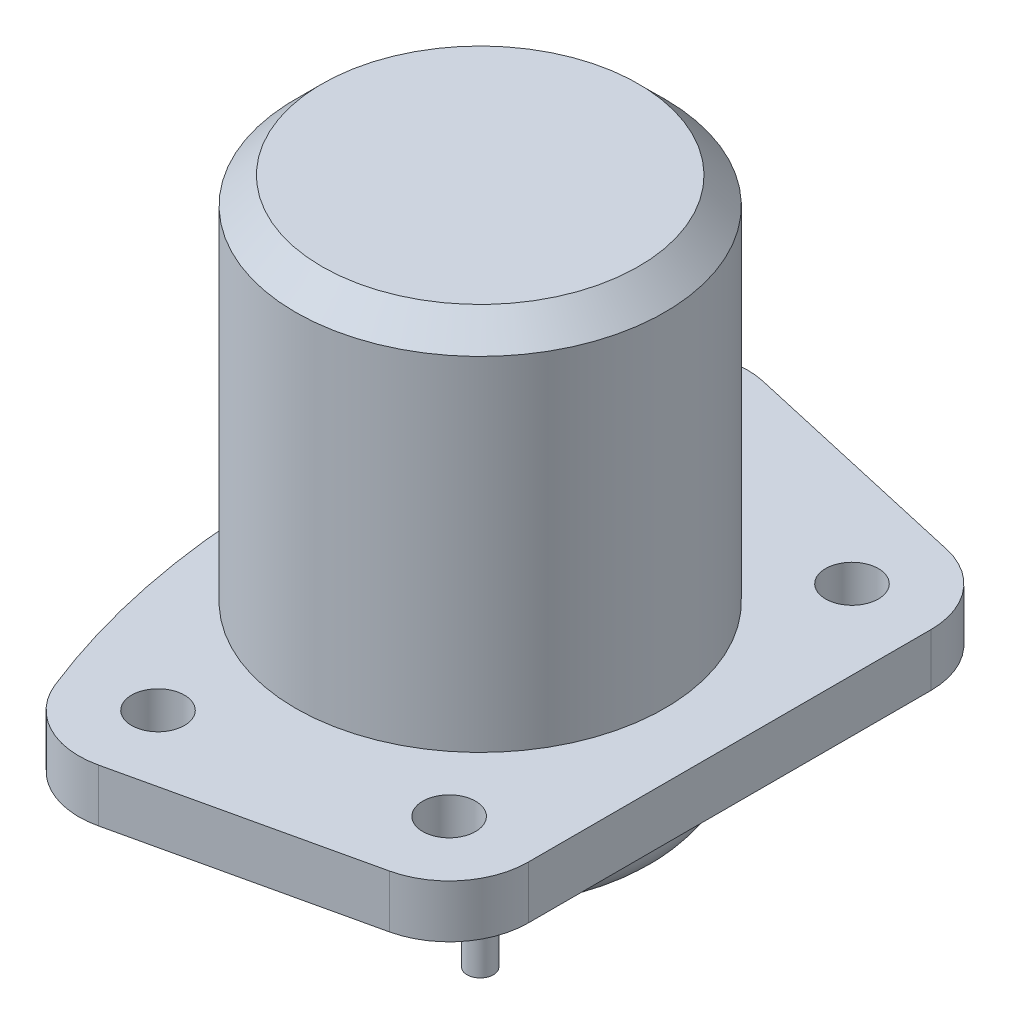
ISO-10303-21;
HEADER;
FILE_DESCRIPTION(('STEP AP214'),'2;1');
FILE_NAME('part.step','',(''),(''),'','','');
FILE_SCHEMA(('AUTOMOTIVE_DESIGN { 1 0 10303 214 1 1 1 1 }'));
ENDSEC;
DATA;
#1=APPLICATION_CONTEXT('core data for automotive mechanical design processes');
#2=APPLICATION_PROTOCOL_DEFINITION('international standard','automotive_design',2000,#1);
#3=PRODUCT_CONTEXT('',#1,'mechanical');
#4=PRODUCT('Part','Part','',(#3));
#5=PRODUCT_RELATED_PRODUCT_CATEGORY('part','',(#4));
#6=PRODUCT_DEFINITION_FORMATION('','',#4);
#7=PRODUCT_DEFINITION_CONTEXT('part definition',#1,'design');
#8=PRODUCT_DEFINITION('design','',#6,#7);
#9=PRODUCT_DEFINITION_SHAPE('','',#8);
#10=(LENGTH_UNIT() NAMED_UNIT(*) SI_UNIT(.MILLI.,.METRE.));
#11=(NAMED_UNIT(*) PLANE_ANGLE_UNIT() SI_UNIT($,.RADIAN.));
#12=(NAMED_UNIT(*) SI_UNIT($,.STERADIAN.) SOLID_ANGLE_UNIT());
#13=UNCERTAINTY_MEASURE_WITH_UNIT(LENGTH_MEASURE(1.E-05),#10,'distance_accuracy_value','');
#14=(GEOMETRIC_REPRESENTATION_CONTEXT(3) GLOBAL_UNCERTAINTY_ASSIGNED_CONTEXT((#13)) GLOBAL_UNIT_ASSIGNED_CONTEXT((#10,
#11,#12)) REPRESENTATION_CONTEXT('',''));
#15=CARTESIAN_POINT('',(0.,0.,0.));
#16=DIRECTION('',(0.,0.,1.));
#17=DIRECTION('',(1.,0.,0.));
#18=AXIS2_PLACEMENT_3D('',#15,#16,#17);
#19=CARTESIAN_POINT('',(0.,50.,0.));
#20=DIRECTION('',(0.,-1.,0.));
#21=DIRECTION('',(0.,0.,-1.));
#22=AXIS2_PLACEMENT_3D('',#19,#20,#21);
#23=CYLINDRICAL_SURFACE('',#22,17.5);
#24=CARTESIAN_POINT('',(0.,5.,0.));
#25=DIRECTION('',(0.,1.,0.));
#26=DIRECTION('',(0.,0.,1.));
#27=AXIS2_PLACEMENT_3D('',#24,#25,#26);
#28=CIRCLE('',#27,17.5);
#29=CARTESIAN_POINT('',(0.,5.,17.5));
#30=VERTEX_POINT('',#29);
#31=EDGE_CURVE('E192',#30,#30,#28,.T.);
#32=ORIENTED_EDGE('',*,*,#31,.T.);
#33=EDGE_LOOP('',(#32));
#34=FACE_BOUND('',#33,.T.);
#35=CARTESIAN_POINT('',(0.,10.,0.));
#36=DIRECTION('',(0.,1.,0.));
#37=DIRECTION('',(0.,0.,1.));
#38=AXIS2_PLACEMENT_3D('',#35,#36,#37);
#39=CIRCLE('',#38,17.5);
#40=CARTESIAN_POINT('',(0.,10.,17.5));
#41=VERTEX_POINT('',#40);
#42=EDGE_CURVE('E11',#41,#41,#39,.T.);
#43=ORIENTED_EDGE('',*,*,#42,.F.);
#44=EDGE_LOOP('',(#43));
#45=FACE_BOUND('',#44,.T.);
#46=ADVANCED_FACE('F36',(#34,#45),#23,.T.);
#47=CARTESIAN_POINT('',(0.,0.,0.));
#48=DIRECTION('',(0.,1.,0.));
#49=DIRECTION('',(0.,0.,1.));
#50=AXIS2_PLACEMENT_3D('',#47,#48,#49);
#51=PLANE('',#50);
#52=CARTESIAN_POINT('',(0.,0.,0.));
#53=DIRECTION('',(0.,1.,0.));
#54=DIRECTION('',(0.,0.,1.));
#55=AXIS2_PLACEMENT_3D('',#52,#53,#54);
#56=CIRCLE('',#55,12.5);
#57=CARTESIAN_POINT('',(0.,0.,12.5));
#58=VERTEX_POINT('',#57);
#59=EDGE_CURVE('E198',#58,#58,#56,.F.);
#60=ORIENTED_EDGE('',*,*,#59,.T.);
#61=EDGE_LOOP('',(#60));
#62=FACE_BOUND('',#61,.T.);
#63=CARTESIAN_POINT('',(0.,0.,0.));
#64=DIRECTION('',(0.,1.,0.));
#65=DIRECTION('',(0.,0.,1.));
#66=AXIS2_PLACEMENT_3D('',#63,#64,#65);
#67=CIRCLE('',#66,1.25);
#68=CARTESIAN_POINT('',(0.,0.,1.25));
#69=VERTEX_POINT('',#68);
#70=EDGE_CURVE('E193',#69,#69,#67,.T.);
#71=ORIENTED_EDGE('',*,*,#70,.T.);
#72=EDGE_LOOP('',(#71));
#73=FACE_BOUND('',#72,.T.);
#74=ADVANCED_FACE('F226',(#62,#73),#51,.F.);
#75=CARTESIAN_POINT('',(0.,-15.,0.));
#76=DIRECTION('',(0.,1.,0.));
#77=DIRECTION('',(0.,0.,1.));
#78=AXIS2_PLACEMENT_3D('',#75,#76,#77);
#79=CYLINDRICAL_SURFACE('',#78,1.25);
#80=CARTESIAN_POINT('',(0.,-15.,0.));
#81=DIRECTION('',(0.,1.,0.));
#82=DIRECTION('',(0.,0.,1.));
#83=AXIS2_PLACEMENT_3D('',#80,#81,#82);
#84=CIRCLE('',#83,1.25);
#85=CARTESIAN_POINT('',(0.,-15.,1.25));
#86=VERTEX_POINT('',#85);
#87=EDGE_CURVE('E189',#86,#86,#84,.T.);
#88=ORIENTED_EDGE('',*,*,#87,.T.);
#89=EDGE_LOOP('',(#88));
#90=FACE_BOUND('',#89,.T.);
#91=ORIENTED_EDGE('',*,*,#70,.F.);
#92=EDGE_LOOP('',(#91));
#93=FACE_BOUND('',#92,.T.);
#94=ADVANCED_FACE('F232',(#90,#93),#79,.T.);
#95=CARTESIAN_POINT('',(0.,-15.,0.));
#96=DIRECTION('',(0.,1.,0.));
#97=DIRECTION('',(0.,0.,1.));
#98=AXIS2_PLACEMENT_3D('',#95,#96,#97);
#99=PLANE('',#98);
#100=ORIENTED_EDGE('',*,*,#87,.F.);
#101=EDGE_LOOP('',(#100));
#102=FACE_BOUND('',#101,.T.);
#103=ADVANCED_FACE('F253',(#102),#99,.F.);
#104=CARTESIAN_POINT('',(0.,5.,0.));
#105=DIRECTION('',(0.,1.,0.));
#106=DIRECTION('',(0.,0.,1.));
#107=AXIS2_PLACEMENT_3D('',#104,#105,#106);
#108=TOROIDAL_SURFACE('',#107,12.5,5.);
#109=ORIENTED_EDGE('',*,*,#59,.F.);
#110=EDGE_LOOP('',(#109));
#111=FACE_BOUND('',#110,.T.);
#112=ORIENTED_EDGE('',*,*,#31,.F.);
#113=EDGE_LOOP('',(#112));
#114=FACE_BOUND('',#113,.T.);
#115=ADVANCED_FACE('F243',(#111,#114),#108,.T.);
#116=CARTESIAN_POINT('',(-58.2735887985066,15.,0.));
#117=DIRECTION('',(0.,1.,0.));
#118=DIRECTION('',(0.,0.,1.));
#119=AXIS2_PLACEMENT_3D('',#116,#117,#118);
#120=PLANE('',#119);
#121=CARTESIAN_POINT('',(16.1451612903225,15.,19.0875290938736));
#122=DIRECTION('',(0.,1.,0.));
#123=DIRECTION('',(0.,0.,1.));
#124=AXIS2_PLACEMENT_3D('',#121,#122,#123);
#125=CIRCLE('',#124,2.5);
#126=CARTESIAN_POINT('',(16.1451612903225,15.,21.5875290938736));
#127=VERTEX_POINT('',#126);
#128=EDGE_CURVE('E143',#127,#127,#125,.T.);
#129=ORIENTED_EDGE('',*,*,#128,.F.);
#130=EDGE_LOOP('',(#129));
#131=FACE_BOUND('',#130,.T.);
#132=CARTESIAN_POINT('',(16.1451612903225,15.,-19.0875290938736));
#133=DIRECTION('',(0.,1.,0.));
#134=DIRECTION('',(0.,0.,1.));
#135=AXIS2_PLACEMENT_3D('',#132,#133,#134);
#136=CIRCLE('',#135,2.5);
#137=CARTESIAN_POINT('',(16.1451612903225,15.,-16.5875290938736));
#138=VERTEX_POINT('',#137);
#139=EDGE_CURVE('E140',#138,#138,#136,.T.);
#140=ORIENTED_EDGE('',*,*,#139,.F.);
#141=EDGE_LOOP('',(#140));
#142=FACE_BOUND('',#141,.T.);
#143=CARTESIAN_POINT('',(-6.35483870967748,15.,-24.1788342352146));
#144=DIRECTION('',(0.,1.,0.));
#145=DIRECTION('',(0.,0.,1.));
#146=AXIS2_PLACEMENT_3D('',#143,#144,#145);
#147=CIRCLE('',#146,2.50000000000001);
#148=CARTESIAN_POINT('',(-6.35483870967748,15.,-21.6788342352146));
#149=VERTEX_POINT('',#148);
#150=EDGE_CURVE('E137',#149,#149,#147,.T.);
#151=ORIENTED_EDGE('',*,*,#150,.F.);
#152=EDGE_LOOP('',(#151));
#153=FACE_BOUND('',#152,.T.);
#154=CARTESIAN_POINT('',(-6.35483870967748,15.,24.1788342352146));
#155=DIRECTION('',(0.,1.,0.));
#156=DIRECTION('',(0.,0.,1.));
#157=AXIS2_PLACEMENT_3D('',#154,#155,#156);
#158=CIRCLE('',#157,2.5);
#159=CARTESIAN_POINT('',(-6.35483870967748,15.,26.6788342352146));
#160=VERTEX_POINT('',#159);
#161=EDGE_CURVE('E131',#160,#160,#158,.T.);
#162=ORIENTED_EDGE('',*,*,#161,.F.);
#163=EDGE_LOOP('',(#162));
#164=FACE_BOUND('',#163,.T.);
#165=DIRECTION('',(0.975341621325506,0.,-0.220700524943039));
#166=VECTOR('',#165,1.);
#167=CARTESIAN_POINT('',(-48.8847415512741,15.,41.4921237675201));
#168=LINE('',#167,#166);
#169=CARTESIAN_POINT('',(-4.69958477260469,15.,31.4938963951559));
#170=VERTEX_POINT('',#169);
#171=CARTESIAN_POINT('',(17.8004152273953,15.,26.4025912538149));
#172=VERTEX_POINT('',#171);
#173=EDGE_CURVE('E177',#170,#172,#168,.T.);
#174=ORIENTED_EDGE('',*,*,#173,.T.);
#175=CARTESIAN_POINT('',(16.1451612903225,15.,19.0875290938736));
#176=DIRECTION('',(0.,1.,0.));
#177=DIRECTION('',(0.,0.,1.));
#178=AXIS2_PLACEMENT_3D('',#175,#176,#177);
#179=CIRCLE('',#178,7.5);
#180=CARTESIAN_POINT('',(23.6451612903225,15.,19.0875290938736));
#181=VERTEX_POINT('',#180);
#182=EDGE_CURVE('E98',#172,#181,#179,.T.);
#183=ORIENTED_EDGE('',*,*,#182,.T.);
#184=DIRECTION('',(0.,0.,1.));
#185=VECTOR('',#184,1.);
#186=CARTESIAN_POINT('',(23.6451612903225,15.,0.));
#187=LINE('',#186,#185);
#188=CARTESIAN_POINT('',(23.6451612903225,15.,-19.0875290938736));
#189=VERTEX_POINT('',#188);
#190=EDGE_CURVE('E463',#189,#181,#187,.T.);
#191=ORIENTED_EDGE('',*,*,#190,.F.);
#192=CARTESIAN_POINT('',(16.1451612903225,15.,-19.0875290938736));
#193=DIRECTION('',(0.,1.,0.));
#194=DIRECTION('',(0.,0.,1.));
#195=AXIS2_PLACEMENT_3D('',#192,#193,#194);
#196=CIRCLE('',#195,7.5);
#197=CARTESIAN_POINT('',(17.8004152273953,15.,-26.4025912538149));
#198=VERTEX_POINT('',#197);
#199=EDGE_CURVE('E465',#189,#198,#196,.T.);
#200=ORIENTED_EDGE('',*,*,#199,.T.);
#201=DIRECTION('',(0.975341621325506,0.,0.22070052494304));
#202=VECTOR('',#201,1.);
#203=CARTESIAN_POINT('',(-48.8847415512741,15.,-41.4921237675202));
#204=LINE('',#203,#202);
#205=CARTESIAN_POINT('',(-4.69958477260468,15.,-31.4938963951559));
#206=VERTEX_POINT('',#205);
#207=EDGE_CURVE('E119',#206,#198,#204,.T.);
#208=ORIENTED_EDGE('',*,*,#207,.F.);
#209=CARTESIAN_POINT('',(-6.35483870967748,15.,-24.1788342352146));
#210=DIRECTION('',(0.,1.,0.));
#211=DIRECTION('',(0.,0.,1.));
#212=AXIS2_PLACEMENT_3D('',#209,#210,#211);
#213=CIRCLE('',#212,7.5);
#214=CARTESIAN_POINT('',(-13.3209121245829,15.,-26.9580105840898));
#215=VERTEX_POINT('',#214);
#216=EDGE_CURVE('E112',#206,#215,#213,.T.);
#217=ORIENTED_EDGE('',*,*,#216,.T.);
#218=CARTESIAN_POINT('',(54.25,15.,0.));
#219=DIRECTION('',(0.,1.,0.));
#220=DIRECTION('',(0.,0.,1.));
#221=AXIS2_PLACEMENT_3D('',#218,#219,#220);
#222=CIRCLE('',#221,72.7500000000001);
#223=CARTESIAN_POINT('',(-13.3209121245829,15.,26.9580105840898));
#224=VERTEX_POINT('',#223);
#225=EDGE_CURVE('E117',#215,#224,#222,.T.);
#226=ORIENTED_EDGE('',*,*,#225,.T.);
#227=CARTESIAN_POINT('',(-6.35483870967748,15.,24.1788342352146));
#228=DIRECTION('',(0.,1.,0.));
#229=DIRECTION('',(0.,0.,1.));
#230=AXIS2_PLACEMENT_3D('',#227,#228,#229);
#231=CIRCLE('',#230,7.5);
#232=EDGE_CURVE('E54',#224,#170,#231,.T.);
#233=ORIENTED_EDGE('',*,*,#232,.T.);
#234=EDGE_LOOP('',(#174,#183,#191,#200,#208,#217,#226,#233));
#235=FACE_BOUND('',#234,.T.);
#236=CARTESIAN_POINT('',(0.,15.,0.));
#237=DIRECTION('',(0.,1.,0.));
#238=DIRECTION('',(0.,0.,1.));
#239=AXIS2_PLACEMENT_3D('',#236,#237,#238);
#240=CIRCLE('',#239,17.5);
#241=CARTESIAN_POINT('',(0.,15.,17.5));
#242=VERTEX_POINT('',#241);
#243=EDGE_CURVE('E40',#242,#242,#240,.T.);
#244=ORIENTED_EDGE('',*,*,#243,.F.);
#245=EDGE_LOOP('',(#244));
#246=FACE_BOUND('',#245,.T.);
#247=ADVANCED_FACE('F114',(#131,#142,#153,#164,#235,#246),#120,.T.);
#248=CARTESIAN_POINT('',(-58.2735887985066,10.,0.));
#249=DIRECTION('',(0.,1.,0.));
#250=DIRECTION('',(0.,0.,1.));
#251=AXIS2_PLACEMENT_3D('',#248,#249,#250);
#252=PLANE('',#251);
#253=CARTESIAN_POINT('',(16.1451612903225,10.,19.0875290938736));
#254=DIRECTION('',(0.,1.,0.));
#255=DIRECTION('',(0.,0.,1.));
#256=AXIS2_PLACEMENT_3D('',#253,#254,#255);
#257=CIRCLE('',#256,2.5);
#258=CARTESIAN_POINT('',(16.1451612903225,10.,21.5875290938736));
#259=VERTEX_POINT('',#258);
#260=EDGE_CURVE('E174',#259,#259,#257,.T.);
#261=ORIENTED_EDGE('',*,*,#260,.T.);
#262=EDGE_LOOP('',(#261));
#263=FACE_BOUND('',#262,.T.);
#264=CARTESIAN_POINT('',(16.1451612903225,10.,-19.0875290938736));
#265=DIRECTION('',(0.,1.,0.));
#266=DIRECTION('',(0.,0.,1.));
#267=AXIS2_PLACEMENT_3D('',#264,#265,#266);
#268=CIRCLE('',#267,2.5);
#269=CARTESIAN_POINT('',(16.1451612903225,10.,-16.5875290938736));
#270=VERTEX_POINT('',#269);
#271=EDGE_CURVE('E171',#270,#270,#268,.T.);
#272=ORIENTED_EDGE('',*,*,#271,.T.);
#273=EDGE_LOOP('',(#272));
#274=FACE_BOUND('',#273,.T.);
#275=CARTESIAN_POINT('',(-6.35483870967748,10.,-24.1788342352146));
#276=DIRECTION('',(0.,1.,0.));
#277=DIRECTION('',(0.,0.,1.));
#278=AXIS2_PLACEMENT_3D('',#275,#276,#277);
#279=CIRCLE('',#278,2.50000000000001);
#280=CARTESIAN_POINT('',(-6.35483870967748,10.,-21.6788342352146));
#281=VERTEX_POINT('',#280);
#282=EDGE_CURVE('E168',#281,#281,#279,.T.);
#283=ORIENTED_EDGE('',*,*,#282,.T.);
#284=EDGE_LOOP('',(#283));
#285=FACE_BOUND('',#284,.T.);
#286=CARTESIAN_POINT('',(-6.35483870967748,10.,24.1788342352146));
#287=DIRECTION('',(0.,1.,0.));
#288=DIRECTION('',(0.,0.,1.));
#289=AXIS2_PLACEMENT_3D('',#286,#287,#288);
#290=CIRCLE('',#289,2.5);
#291=CARTESIAN_POINT('',(-6.35483870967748,10.,26.6788342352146));
#292=VERTEX_POINT('',#291);
#293=EDGE_CURVE('E165',#292,#292,#290,.T.);
#294=ORIENTED_EDGE('',*,*,#293,.T.);
#295=EDGE_LOOP('',(#294));
#296=FACE_BOUND('',#295,.T.);
#297=DIRECTION('',(0.975341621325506,0.,-0.220700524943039));
#298=VECTOR('',#297,1.);
#299=CARTESIAN_POINT('',(-48.8847415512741,10.,41.4921237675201));
#300=LINE('',#299,#298);
#301=CARTESIAN_POINT('',(-4.69958477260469,10.,31.4938963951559));
#302=VERTEX_POINT('',#301);
#303=CARTESIAN_POINT('',(17.8004152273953,10.,26.4025912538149));
#304=VERTEX_POINT('',#303);
#305=EDGE_CURVE('E147',#302,#304,#300,.T.);
#306=ORIENTED_EDGE('',*,*,#305,.F.);
#307=CARTESIAN_POINT('',(-6.35483870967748,10.,24.1788342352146));
#308=DIRECTION('',(0.,1.,0.));
#309=DIRECTION('',(0.,0.,1.));
#310=AXIS2_PLACEMENT_3D('',#307,#308,#309);
#311=CIRCLE('',#310,7.5);
#312=CARTESIAN_POINT('',(-13.3209121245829,10.,26.9580105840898));
#313=VERTEX_POINT('',#312);
#314=EDGE_CURVE('E89',#313,#302,#311,.T.);
#315=ORIENTED_EDGE('',*,*,#314,.F.);
#316=CARTESIAN_POINT('',(54.25,10.,0.));
#317=DIRECTION('',(0.,1.,0.));
#318=DIRECTION('',(0.,0.,1.));
#319=AXIS2_PLACEMENT_3D('',#316,#317,#318);
#320=CIRCLE('',#319,72.7500000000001);
#321=CARTESIAN_POINT('',(-13.3209121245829,10.,-26.9580105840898));
#322=VERTEX_POINT('',#321);
#323=EDGE_CURVE('E83',#322,#313,#320,.T.);
#324=ORIENTED_EDGE('',*,*,#323,.F.);
#325=CARTESIAN_POINT('',(-6.35483870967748,10.,-24.1788342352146));
#326=DIRECTION('',(0.,1.,0.));
#327=DIRECTION('',(0.,0.,1.));
#328=AXIS2_PLACEMENT_3D('',#325,#326,#327);
#329=CIRCLE('',#328,7.5);
#330=CARTESIAN_POINT('',(-4.69958477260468,10.,-31.4938963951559));
#331=VERTEX_POINT('',#330);
#332=EDGE_CURVE('E125',#331,#322,#329,.T.);
#333=ORIENTED_EDGE('',*,*,#332,.F.);
#334=DIRECTION('',(0.975341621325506,0.,0.22070052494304));
#335=VECTOR('',#334,1.);
#336=CARTESIAN_POINT('',(-48.8847415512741,10.,-41.4921237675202));
#337=LINE('',#336,#335);
#338=CARTESIAN_POINT('',(17.8004152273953,10.,-26.4025912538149));
#339=VERTEX_POINT('',#338);
#340=EDGE_CURVE('E159',#331,#339,#337,.T.);
#341=ORIENTED_EDGE('',*,*,#340,.T.);
#342=CARTESIAN_POINT('',(16.1451612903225,10.,-19.0875290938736));
#343=DIRECTION('',(0.,1.,0.));
#344=DIRECTION('',(0.,0.,1.));
#345=AXIS2_PLACEMENT_3D('',#342,#343,#344);
#346=CIRCLE('',#345,7.5);
#347=CARTESIAN_POINT('',(23.6451612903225,10.,-19.0875290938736));
#348=VERTEX_POINT('',#347);
#349=EDGE_CURVE('E156',#348,#339,#346,.T.);
#350=ORIENTED_EDGE('',*,*,#349,.F.);
#351=DIRECTION('',(0.,0.,1.));
#352=VECTOR('',#351,1.);
#353=CARTESIAN_POINT('',(23.6451612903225,10.,0.));
#354=LINE('',#353,#352);
#355=CARTESIAN_POINT('',(23.6451612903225,10.,19.0875290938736));
#356=VERTEX_POINT('',#355);
#357=EDGE_CURVE('E153',#348,#356,#354,.T.);
#358=ORIENTED_EDGE('',*,*,#357,.T.);
#359=CARTESIAN_POINT('',(16.1451612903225,10.,19.0875290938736));
#360=DIRECTION('',(0.,1.,0.));
#361=DIRECTION('',(0.,0.,1.));
#362=AXIS2_PLACEMENT_3D('',#359,#360,#361);
#363=CIRCLE('',#362,7.5);
#364=EDGE_CURVE('E150',#304,#356,#363,.T.);
#365=ORIENTED_EDGE('',*,*,#364,.F.);
#366=EDGE_LOOP('',(#306,#315,#324,#333,#341,#350,#358,#365));
#367=FACE_BOUND('',#366,.T.);
#368=ORIENTED_EDGE('',*,*,#42,.T.);
#369=EDGE_LOOP('',(#368));
#370=FACE_BOUND('',#369,.T.);
#371=ADVANCED_FACE('F242',(#263,#274,#285,#296,#367,#370),#252,.F.);
#372=CARTESIAN_POINT('',(-48.8847415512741,15.,41.4921237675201));
#373=DIRECTION('',(-0.220700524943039,0.,-0.975341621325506));
#374=DIRECTION('',(-0.975341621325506,0.,0.220700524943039));
#375=AXIS2_PLACEMENT_3D('',#372,#373,#374);
#376=PLANE('',#375);
#377=ORIENTED_EDGE('',*,*,#305,.T.);
#378=DIRECTION('',(0.,-1.,0.));
#379=VECTOR('',#378,1.);
#380=CARTESIAN_POINT('',(17.8004152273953,15.,26.4025912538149));
#381=LINE('',#380,#379);
#382=EDGE_CURVE('E187',#172,#304,#381,.T.);
#383=ORIENTED_EDGE('',*,*,#382,.F.);
#384=ORIENTED_EDGE('',*,*,#173,.F.);
#385=DIRECTION('',(0.,-1.,0.));
#386=VECTOR('',#385,1.);
#387=CARTESIAN_POINT('',(-4.69958477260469,15.,31.4938963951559));
#388=LINE('',#387,#386);
#389=EDGE_CURVE('E146',#170,#302,#388,.T.);
#390=ORIENTED_EDGE('',*,*,#389,.T.);
#391=EDGE_LOOP('',(#377,#383,#384,#390));
#392=FACE_BOUND('',#391,.T.);
#393=ADVANCED_FACE('F250',(#392),#376,.F.);
#394=CARTESIAN_POINT('',(16.1451612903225,15.,19.0875290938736));
#395=DIRECTION('',(0.,-1.,0.));
#396=DIRECTION('',(0.,0.,-1.));
#397=AXIS2_PLACEMENT_3D('',#394,#395,#396);
#398=CYLINDRICAL_SURFACE('',#397,7.5);
#399=ORIENTED_EDGE('',*,*,#364,.T.);
#400=DIRECTION('',(0.,-1.,0.));
#401=VECTOR('',#400,1.);
#402=CARTESIAN_POINT('',(23.6451612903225,15.,19.0875290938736));
#403=LINE('',#402,#401);
#404=EDGE_CURVE('E185',#181,#356,#403,.T.);
#405=ORIENTED_EDGE('',*,*,#404,.F.);
#406=ORIENTED_EDGE('',*,*,#182,.F.);
#407=ORIENTED_EDGE('',*,*,#382,.T.);
#408=EDGE_LOOP('',(#399,#405,#406,#407));
#409=FACE_BOUND('',#408,.T.);
#410=ADVANCED_FACE('F287',(#409),#398,.T.);
#411=CARTESIAN_POINT('',(23.6451612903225,15.,0.));
#412=DIRECTION('',(1.,0.,0.));
#413=DIRECTION('',(0.,0.,-1.));
#414=AXIS2_PLACEMENT_3D('',#411,#412,#413);
#415=PLANE('',#414);
#416=ORIENTED_EDGE('',*,*,#357,.F.);
#417=DIRECTION('',(0.,-1.,0.));
#418=VECTOR('',#417,1.);
#419=CARTESIAN_POINT('',(23.6451612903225,15.,-19.0875290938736));
#420=LINE('',#419,#418);
#421=EDGE_CURVE('E183',#189,#348,#420,.T.);
#422=ORIENTED_EDGE('',*,*,#421,.F.);
#423=ORIENTED_EDGE('',*,*,#190,.T.);
#424=ORIENTED_EDGE('',*,*,#404,.T.);
#425=EDGE_LOOP('',(#416,#422,#423,#424));
#426=FACE_BOUND('',#425,.T.);
#427=ADVANCED_FACE('F283',(#426),#415,.T.);
#428=CARTESIAN_POINT('',(16.1451612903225,15.,-19.0875290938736));
#429=DIRECTION('',(0.,-1.,0.));
#430=DIRECTION('',(0.,0.,-1.));
#431=AXIS2_PLACEMENT_3D('',#428,#429,#430);
#432=CYLINDRICAL_SURFACE('',#431,7.5);
#433=ORIENTED_EDGE('',*,*,#349,.T.);
#434=DIRECTION('',(0.,-1.,0.));
#435=VECTOR('',#434,1.);
#436=CARTESIAN_POINT('',(17.8004152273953,15.,-26.4025912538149));
#437=LINE('',#436,#435);
#438=EDGE_CURVE('E181',#198,#339,#437,.T.);
#439=ORIENTED_EDGE('',*,*,#438,.F.);
#440=ORIENTED_EDGE('',*,*,#199,.F.);
#441=ORIENTED_EDGE('',*,*,#421,.T.);
#442=EDGE_LOOP('',(#433,#439,#440,#441));
#443=FACE_BOUND('',#442,.T.);
#444=ADVANCED_FACE('F279',(#443),#432,.T.);
#445=CARTESIAN_POINT('',(-48.8847415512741,15.,-41.4921237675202));
#446=DIRECTION('',(0.220700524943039,0.,-0.975341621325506));
#447=DIRECTION('',(-0.975341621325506,0.,-0.220700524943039));
#448=AXIS2_PLACEMENT_3D('',#445,#446,#447);
#449=PLANE('',#448);
#450=ORIENTED_EDGE('',*,*,#340,.F.);
#451=DIRECTION('',(0.,-1.,0.));
#452=VECTOR('',#451,1.);
#453=CARTESIAN_POINT('',(-4.69958477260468,15.,-31.4938963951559));
#454=LINE('',#453,#452);
#455=EDGE_CURVE('E126',#206,#331,#454,.T.);
#456=ORIENTED_EDGE('',*,*,#455,.F.);
#457=ORIENTED_EDGE('',*,*,#207,.T.);
#458=ORIENTED_EDGE('',*,*,#438,.T.);
#459=EDGE_LOOP('',(#450,#456,#457,#458));
#460=FACE_BOUND('',#459,.T.);
#461=ADVANCED_FACE('F276',(#460),#449,.T.);
#462=CARTESIAN_POINT('',(-6.35483870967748,15.,-24.1788342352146));
#463=DIRECTION('',(0.,-1.,0.));
#464=DIRECTION('',(0.,0.,-1.));
#465=AXIS2_PLACEMENT_3D('',#462,#463,#464);
#466=CYLINDRICAL_SURFACE('',#465,7.5);
#467=ORIENTED_EDGE('',*,*,#332,.T.);
#468=DIRECTION('',(0.,-1.,0.));
#469=VECTOR('',#468,1.);
#470=CARTESIAN_POINT('',(-13.3209121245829,15.,-26.9580105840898));
#471=LINE('',#470,#469);
#472=EDGE_CURVE('E122',#215,#322,#471,.T.);
#473=ORIENTED_EDGE('',*,*,#472,.F.);
#474=ORIENTED_EDGE('',*,*,#216,.F.);
#475=ORIENTED_EDGE('',*,*,#455,.T.);
#476=EDGE_LOOP('',(#467,#473,#474,#475));
#477=FACE_BOUND('',#476,.T.);
#478=ADVANCED_FACE('F123',(#477),#466,.T.);
#479=CARTESIAN_POINT('',(54.25,15.,0.));
#480=DIRECTION('',(0.,-1.,0.));
#481=DIRECTION('',(0.,0.,-1.));
#482=AXIS2_PLACEMENT_3D('',#479,#480,#481);
#483=CYLINDRICAL_SURFACE('',#482,72.7500000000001);
#484=ORIENTED_EDGE('',*,*,#323,.T.);
#485=DIRECTION('',(0.,-1.,0.));
#486=VECTOR('',#485,1.);
#487=CARTESIAN_POINT('',(-13.3209121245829,15.,26.9580105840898));
#488=LINE('',#487,#486);
#489=EDGE_CURVE('E127',#224,#313,#488,.T.);
#490=ORIENTED_EDGE('',*,*,#489,.F.);
#491=ORIENTED_EDGE('',*,*,#225,.F.);
#492=ORIENTED_EDGE('',*,*,#472,.T.);
#493=EDGE_LOOP('',(#484,#490,#491,#492));
#494=FACE_BOUND('',#493,.T.);
#495=ADVANCED_FACE('F129',(#494),#483,.T.);
#496=CARTESIAN_POINT('',(16.1451612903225,15.,-19.0875290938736));
#497=DIRECTION('',(0.,-1.,0.));
#498=DIRECTION('',(0.,0.,-1.));
#499=AXIS2_PLACEMENT_3D('',#496,#497,#498);
#500=CYLINDRICAL_SURFACE('',#499,2.5);
#501=ORIENTED_EDGE('',*,*,#139,.T.);
#502=EDGE_LOOP('',(#501));
#503=FACE_BOUND('',#502,.T.);
#504=ORIENTED_EDGE('',*,*,#271,.F.);
#505=EDGE_LOOP('',(#504));
#506=FACE_BOUND('',#505,.T.);
#507=ADVANCED_FACE('F258',(#503,#506),#500,.F.);
#508=CARTESIAN_POINT('',(-6.35483870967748,15.,-24.1788342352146));
#509=DIRECTION('',(0.,-1.,0.));
#510=DIRECTION('',(0.,0.,-1.));
#511=AXIS2_PLACEMENT_3D('',#508,#509,#510);
#512=CYLINDRICAL_SURFACE('',#511,2.50000000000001);
#513=ORIENTED_EDGE('',*,*,#150,.T.);
#514=EDGE_LOOP('',(#513));
#515=FACE_BOUND('',#514,.T.);
#516=ORIENTED_EDGE('',*,*,#282,.F.);
#517=EDGE_LOOP('',(#516));
#518=FACE_BOUND('',#517,.T.);
#519=ADVANCED_FACE('F261',(#515,#518),#512,.F.);
#520=CARTESIAN_POINT('',(-6.35483870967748,15.,24.1788342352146));
#521=DIRECTION('',(0.,-1.,0.));
#522=DIRECTION('',(0.,0.,-1.));
#523=AXIS2_PLACEMENT_3D('',#520,#521,#522);
#524=CYLINDRICAL_SURFACE('',#523,2.5);
#525=ORIENTED_EDGE('',*,*,#161,.T.);
#526=EDGE_LOOP('',(#525));
#527=FACE_BOUND('',#526,.T.);
#528=ORIENTED_EDGE('',*,*,#293,.F.);
#529=EDGE_LOOP('',(#528));
#530=FACE_BOUND('',#529,.T.);
#531=ADVANCED_FACE('F265',(#527,#530),#524,.F.);
#532=CARTESIAN_POINT('',(-6.35483870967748,15.,24.1788342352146));
#533=DIRECTION('',(0.,-1.,0.));
#534=DIRECTION('',(0.,0.,-1.));
#535=AXIS2_PLACEMENT_3D('',#532,#533,#534);
#536=CYLINDRICAL_SURFACE('',#535,7.5);
#537=ORIENTED_EDGE('',*,*,#314,.T.);
#538=ORIENTED_EDGE('',*,*,#389,.F.);
#539=ORIENTED_EDGE('',*,*,#232,.F.);
#540=ORIENTED_EDGE('',*,*,#489,.T.);
#541=EDGE_LOOP('',(#537,#538,#539,#540));
#542=FACE_BOUND('',#541,.T.);
#543=ADVANCED_FACE('F220',(#542),#536,.T.);
#544=CARTESIAN_POINT('',(16.1451612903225,15.,19.0875290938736));
#545=DIRECTION('',(0.,-1.,0.));
#546=DIRECTION('',(0.,0.,-1.));
#547=AXIS2_PLACEMENT_3D('',#544,#545,#546);
#548=CYLINDRICAL_SURFACE('',#547,2.5);
#549=ORIENTED_EDGE('',*,*,#128,.T.);
#550=EDGE_LOOP('',(#549));
#551=FACE_BOUND('',#550,.T.);
#552=ORIENTED_EDGE('',*,*,#260,.F.);
#553=EDGE_LOOP('',(#552));
#554=FACE_BOUND('',#553,.T.);
#555=ADVANCED_FACE('F215',(#551,#554),#548,.F.);
#556=CARTESIAN_POINT('',(0.,50.,0.));
#557=DIRECTION('',(0.,1.,0.));
#558=DIRECTION('',(0.,0.,1.));
#559=AXIS2_PLACEMENT_3D('',#556,#557,#558);
#560=PLANE('',#559);
#561=CARTESIAN_POINT('',(0.,50.,0.));
#562=DIRECTION('',(0.,1.,0.));
#563=DIRECTION('',(0.,0.,1.));
#564=AXIS2_PLACEMENT_3D('',#561,#562,#563);
#565=CIRCLE('',#564,15.);
#566=CARTESIAN_POINT('',(0.,50.,15.));
#567=VERTEX_POINT('',#566);
#568=EDGE_CURVE('E201',#567,#567,#565,.T.);
#569=ORIENTED_EDGE('',*,*,#568,.T.);
#570=EDGE_LOOP('',(#569));
#571=FACE_BOUND('',#570,.T.);
#572=ADVANCED_FACE('F211',(#571),#560,.T.);
#573=CARTESIAN_POINT('',(0.,50.,0.));
#574=DIRECTION('',(0.,-1.,0.));
#575=DIRECTION('',(0.,0.,-1.));
#576=AXIS2_PLACEMENT_3D('',#573,#574,#575);
#577=CONICAL_SURFACE('',#576,15.,0.785398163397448);
#578=CARTESIAN_POINT('',(0.,47.5,0.));
#579=DIRECTION('',(0.,1.,0.));
#580=DIRECTION('',(0.,0.,1.));
#581=AXIS2_PLACEMENT_3D('',#578,#579,#580);
#582=CIRCLE('',#581,17.5);
#583=CARTESIAN_POINT('',(0.,47.5,17.5));
#584=VERTEX_POINT('',#583);
#585=EDGE_CURVE('E46',#584,#584,#582,.F.);
#586=ORIENTED_EDGE('',*,*,#585,.F.);
#587=EDGE_LOOP('',(#586));
#588=FACE_BOUND('',#587,.T.);
#589=ORIENTED_EDGE('',*,*,#568,.F.);
#590=EDGE_LOOP('',(#589));
#591=FACE_BOUND('',#590,.T.);
#592=ADVANCED_FACE('F38',(#588,#591),#577,.T.);
#593=ORIENTED_EDGE('',*,*,#243,.T.);
#594=EDGE_LOOP('',(#593));
#595=FACE_BOUND('',#594,.T.);
#596=ORIENTED_EDGE('',*,*,#585,.T.);
#597=EDGE_LOOP('',(#596));
#598=FACE_BOUND('',#597,.T.);
#599=ADVANCED_FACE('F207',(#595,#598),#23,.T.);
#600=CLOSED_SHELL('',(#46,#74,#94,#103,#115,#247,#371,#393,#410,#427,#444,#461,#478,#495,#507,
#519,#531,#543,#555,#572,#592,#599));
#601=MANIFOLD_SOLID_BREP('B2',#600);
#602=ADVANCED_BREP_SHAPE_REPRESENTATION('',(#18,#601),#14);
#603=SHAPE_DEFINITION_REPRESENTATION(#9,#602);
ENDSEC;
END-ISO-10303-21;
